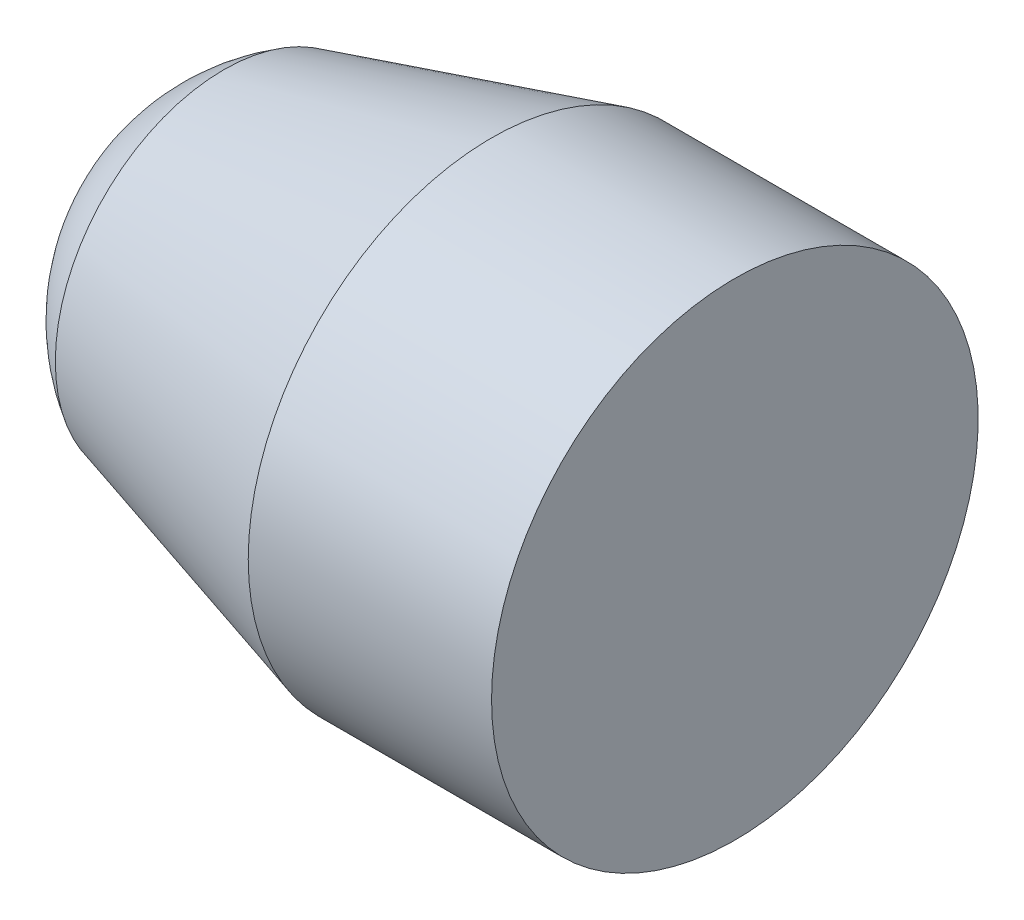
from build123d import *


with BuildPart() as part:
    # Sketch1 → Revolve6 (revolve)
    with BuildSketch(Plane.XY, mode=Mode.PRIVATE) as revolve6_sk:
        with BuildLine():
            Line((1.016, 1.75976362), (3.81, 2.54))
            Line((3.81, 2.54), (6.35, 2.54))
            Line((6.35, 2.54), (6.35, 0))
            Line((6.35, 0), (0, 0))
            ThreePointArc((0, 0), (0.27223638, 1.016), (1.016, 1.75976362))
        make_face()
    revolve(revolve6_sk.sketch.rotate(Axis((-0.342165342, 0, 0), (1, 0, 0)), 90), axis=Axis((-0.342165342, 0, 0), (1, 0, 0)))


solid = part.part
